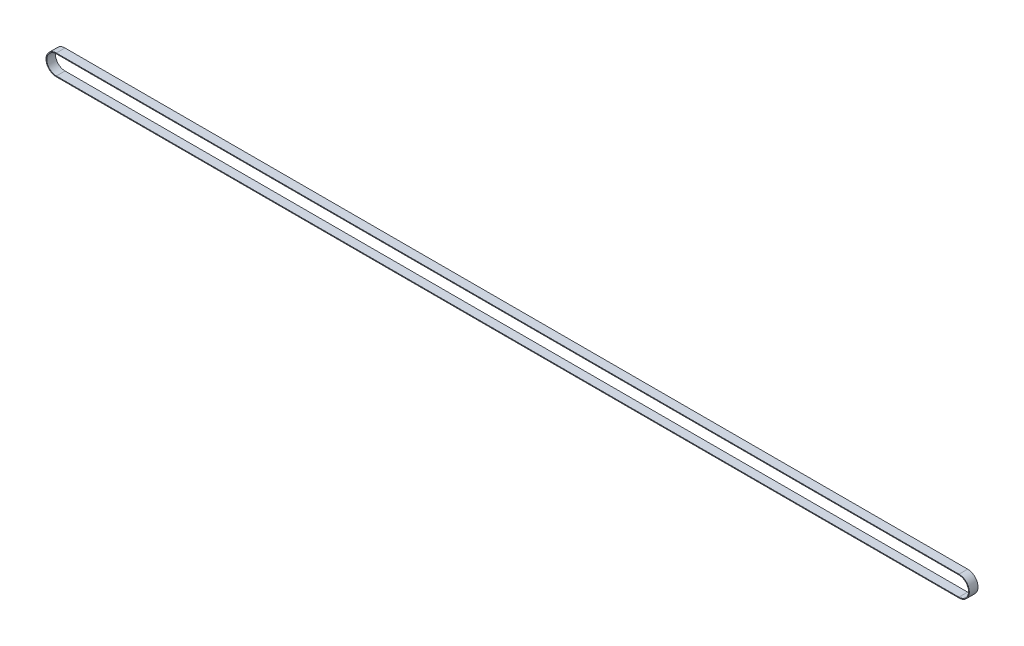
ISO-10303-21;
HEADER;
FILE_DESCRIPTION(('STEP AP214'),'2;1');
FILE_NAME('part.step','',(''),(''),'','','');
FILE_SCHEMA(('AUTOMOTIVE_DESIGN { 1 0 10303 214 1 1 1 1 }'));
ENDSEC;
DATA;
#1=APPLICATION_CONTEXT('core data for automotive mechanical design processes');
#2=APPLICATION_PROTOCOL_DEFINITION('international standard','automotive_design',2000,#1);
#3=PRODUCT_CONTEXT('',#1,'mechanical');
#4=PRODUCT('Part','Part','',(#3));
#5=PRODUCT_RELATED_PRODUCT_CATEGORY('part','',(#4));
#6=PRODUCT_DEFINITION_FORMATION('','',#4);
#7=PRODUCT_DEFINITION_CONTEXT('part definition',#1,'design');
#8=PRODUCT_DEFINITION('design','',#6,#7);
#9=PRODUCT_DEFINITION_SHAPE('','',#8);
#10=(LENGTH_UNIT() NAMED_UNIT(*) SI_UNIT(.MILLI.,.METRE.));
#11=(NAMED_UNIT(*) PLANE_ANGLE_UNIT() SI_UNIT($,.RADIAN.));
#12=(NAMED_UNIT(*) SI_UNIT($,.STERADIAN.) SOLID_ANGLE_UNIT());
#13=UNCERTAINTY_MEASURE_WITH_UNIT(LENGTH_MEASURE(1.E-05),#10,'distance_accuracy_value','');
#14=(GEOMETRIC_REPRESENTATION_CONTEXT(3) GLOBAL_UNCERTAINTY_ASSIGNED_CONTEXT((#13)) GLOBAL_UNIT_ASSIGNED_CONTEXT((#10,
#11,#12)) REPRESENTATION_CONTEXT('',''));
#15=CARTESIAN_POINT('',(0.,0.,0.));
#16=DIRECTION('',(0.,0.,1.));
#17=DIRECTION('',(1.,0.,0.));
#18=AXIS2_PLACEMENT_3D('',#15,#16,#17);
#19=CARTESIAN_POINT('',(2598.49999999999,29.7500000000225,12.5));
#20=DIRECTION('',(0.,0.,-1.));
#21=DIRECTION('',(-1.,0.,0.));
#22=AXIS2_PLACEMENT_3D('',#19,#20,#21);
#23=PLANE('',#22);
#24=DIRECTION('',(0.,-1.,0.));
#25=VECTOR('',#24,1.);
#26=CARTESIAN_POINT('',(2598.49999999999,29.7500000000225,12.5));
#27=LINE('',#26,#25);
#28=CARTESIAN_POINT('',(2598.49999999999,29.7500000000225,12.5));
#29=VERTEX_POINT('',#28);
#30=CARTESIAN_POINT('',(2598.49999999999,27.5500000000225,12.5));
#31=VERTEX_POINT('',#30);
#32=EDGE_CURVE('E151',#29,#31,#27,.T.);
#33=ORIENTED_EDGE('',*,*,#32,.F.);
#34=DIRECTION('',(-1.,0.,0.));
#35=VECTOR('',#34,1.);
#36=CARTESIAN_POINT('',(2598.49999999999,29.7500000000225,12.5));
#37=LINE('',#36,#35);
#38=CARTESIAN_POINT('',(0.,29.7500000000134,12.5));
#39=VERTEX_POINT('',#38);
#40=EDGE_CURVE('E150',#29,#39,#37,.T.);
#41=ORIENTED_EDGE('',*,*,#40,.T.);
#42=DIRECTION('',(0.,-1.,0.));
#43=VECTOR('',#42,1.);
#44=CARTESIAN_POINT('',(0.,29.7500000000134,12.5));
#45=LINE('',#44,#43);
#46=CARTESIAN_POINT('',(0.,27.5500000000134,12.5));
#47=VERTEX_POINT('',#46);
#48=EDGE_CURVE('E129',#39,#47,#45,.T.);
#49=ORIENTED_EDGE('',*,*,#48,.T.);
#50=DIRECTION('',(-1.,0.,0.));
#51=VECTOR('',#50,1.);
#52=CARTESIAN_POINT('',(2598.49999999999,27.5500000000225,12.5));
#53=LINE('',#52,#51);
#54=EDGE_CURVE('E155',#31,#47,#53,.T.);
#55=ORIENTED_EDGE('',*,*,#54,.F.);
#56=EDGE_LOOP('',(#33,#41,#49,#55));
#57=FACE_BOUND('',#56,.T.);
#58=ADVANCED_FACE('F35',(#57),#23,.F.);
#59=CARTESIAN_POINT('',(0.,29.7500000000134,12.5));
#60=DIRECTION('',(0.,0.,-1.));
#61=DIRECTION('',(-1.,0.,0.));
#62=AXIS2_PLACEMENT_3D('',#59,#60,#61);
#63=PLANE('',#62);
#64=CARTESIAN_POINT('',(-6.66133814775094E-12,0.,12.5));
#65=DIRECTION('',(0.,0.,1.));
#66=DIRECTION('',(2.41790858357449E-13,1.,0.));
#67=AXIS2_PLACEMENT_3D('',#64,#65,#66);
#68=CIRCLE('',#67,27.5500000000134);
#69=CARTESIAN_POINT('',(0.,-27.5500000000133,12.5));
#70=VERTEX_POINT('',#69);
#71=EDGE_CURVE('E119',#47,#70,#68,.T.);
#72=ORIENTED_EDGE('',*,*,#71,.F.);
#73=ORIENTED_EDGE('',*,*,#48,.F.);
#74=CARTESIAN_POINT('',(-6.66133814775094E-12,0.,12.5));
#75=DIRECTION('',(0.,0.,1.));
#76=DIRECTION('',(2.23910525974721E-13,1.,0.));
#77=AXIS2_PLACEMENT_3D('',#74,#75,#76);
#78=CIRCLE('',#77,29.7500000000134);
#79=CARTESIAN_POINT('',(0.,-29.7500000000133,12.5));
#80=VERTEX_POINT('',#79);
#81=EDGE_CURVE('E132',#39,#80,#78,.T.);
#82=ORIENTED_EDGE('',*,*,#81,.T.);
#83=DIRECTION('',(0.,1.,0.));
#84=VECTOR('',#83,1.);
#85=CARTESIAN_POINT('',(0.,-29.7500000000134,12.5));
#86=LINE('',#85,#84);
#87=EDGE_CURVE('E147',#80,#70,#86,.T.);
#88=ORIENTED_EDGE('',*,*,#87,.T.);
#89=EDGE_LOOP('',(#72,#73,#82,#88));
#90=FACE_BOUND('',#89,.T.);
#91=ADVANCED_FACE('F131',(#90),#63,.F.);
#92=CARTESIAN_POINT('',(-6.66133814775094E-12,0.,0.));
#93=DIRECTION('',(0.,0.,1.));
#94=DIRECTION('',(1.,0.,0.));
#95=AXIS2_PLACEMENT_3D('',#92,#93,#94);
#96=CYLINDRICAL_SURFACE('',#95,27.5500000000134);
#97=CARTESIAN_POINT('',(-6.66133814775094E-12,0.,-12.5));
#98=DIRECTION('',(0.,0.,1.));
#99=DIRECTION('',(2.41790858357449E-13,1.,0.));
#100=AXIS2_PLACEMENT_3D('',#97,#98,#99);
#101=CIRCLE('',#100,27.5500000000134);
#102=CARTESIAN_POINT('',(0.,27.5500000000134,-12.5));
#103=VERTEX_POINT('',#102);
#104=CARTESIAN_POINT('',(0.,-27.5500000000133,-12.5));
#105=VERTEX_POINT('',#104);
#106=EDGE_CURVE('E113',#103,#105,#101,.T.);
#107=ORIENTED_EDGE('',*,*,#106,.F.);
#108=DIRECTION('',(0.,0.,-1.));
#109=VECTOR('',#108,1.);
#110=CARTESIAN_POINT('',(0.,27.5500000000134,12.5));
#111=LINE('',#110,#109);
#112=EDGE_CURVE('E137',#47,#103,#111,.T.);
#113=ORIENTED_EDGE('',*,*,#112,.F.);
#114=ORIENTED_EDGE('',*,*,#71,.T.);
#115=DIRECTION('',(0.,0.,-1.));
#116=VECTOR('',#115,1.);
#117=CARTESIAN_POINT('',(0.,-27.5500000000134,12.5));
#118=LINE('',#117,#116);
#119=EDGE_CURVE('E195',#70,#105,#118,.T.);
#120=ORIENTED_EDGE('',*,*,#119,.T.);
#121=EDGE_LOOP('',(#107,#113,#114,#120));
#122=FACE_BOUND('',#121,.T.);
#123=ADVANCED_FACE('F214',(#122),#96,.F.);
#124=CARTESIAN_POINT('',(0.,29.7500000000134,-12.5));
#125=DIRECTION('',(0.,0.,1.));
#126=DIRECTION('',(1.,0.,0.));
#127=AXIS2_PLACEMENT_3D('',#124,#125,#126);
#128=PLANE('',#127);
#129=CARTESIAN_POINT('',(-6.66133814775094E-12,0.,-12.5));
#130=DIRECTION('',(0.,0.,1.));
#131=DIRECTION('',(2.23910525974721E-13,1.,0.));
#132=AXIS2_PLACEMENT_3D('',#129,#130,#131);
#133=CIRCLE('',#132,29.7500000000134);
#134=CARTESIAN_POINT('',(0.,29.7500000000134,-12.5));
#135=VERTEX_POINT('',#134);
#136=CARTESIAN_POINT('',(0.,-29.7500000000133,-12.5));
#137=VERTEX_POINT('',#136);
#138=EDGE_CURVE('E165',#135,#137,#133,.T.);
#139=ORIENTED_EDGE('',*,*,#138,.F.);
#140=DIRECTION('',(0.,1.,0.));
#141=VECTOR('',#140,1.);
#142=CARTESIAN_POINT('',(0.,29.7500000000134,-12.5));
#143=LINE('',#142,#141);
#144=EDGE_CURVE('E158',#103,#135,#143,.T.);
#145=ORIENTED_EDGE('',*,*,#144,.F.);
#146=ORIENTED_EDGE('',*,*,#106,.T.);
#147=DIRECTION('',(0.,-1.,0.));
#148=VECTOR('',#147,1.);
#149=CARTESIAN_POINT('',(0.,-29.7500000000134,-12.5));
#150=LINE('',#149,#148);
#151=EDGE_CURVE('E183',#105,#137,#150,.T.);
#152=ORIENTED_EDGE('',*,*,#151,.T.);
#153=EDGE_LOOP('',(#139,#145,#146,#152));
#154=FACE_BOUND('',#153,.T.);
#155=ADVANCED_FACE('F182',(#154),#128,.F.);
#156=CARTESIAN_POINT('',(-6.66133814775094E-12,0.,0.));
#157=DIRECTION('',(0.,0.,1.));
#158=DIRECTION('',(1.,0.,0.));
#159=AXIS2_PLACEMENT_3D('',#156,#157,#158);
#160=CYLINDRICAL_SURFACE('',#159,29.7500000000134);
#161=DIRECTION('',(0.,0.,1.));
#162=VECTOR('',#161,1.);
#163=CARTESIAN_POINT('',(0.,-29.7500000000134,12.5));
#164=LINE('',#163,#162);
#165=EDGE_CURVE('E145',#137,#80,#164,.T.);
#166=ORIENTED_EDGE('',*,*,#165,.T.);
#167=ORIENTED_EDGE('',*,*,#81,.F.);
#168=DIRECTION('',(0.,0.,1.));
#169=VECTOR('',#168,1.);
#170=CARTESIAN_POINT('',(0.,29.7500000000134,12.5));
#171=LINE('',#170,#169);
#172=EDGE_CURVE('E144',#135,#39,#171,.T.);
#173=ORIENTED_EDGE('',*,*,#172,.F.);
#174=ORIENTED_EDGE('',*,*,#138,.T.);
#175=EDGE_LOOP('',(#166,#167,#173,#174));
#176=FACE_BOUND('',#175,.T.);
#177=ADVANCED_FACE('F142',(#176),#160,.T.);
#178=CARTESIAN_POINT('',(0.,-29.7500000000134,12.5));
#179=DIRECTION('',(0.,0.,-1.));
#180=DIRECTION('',(-1.,0.,0.));
#181=AXIS2_PLACEMENT_3D('',#178,#179,#180);
#182=PLANE('',#181);
#183=DIRECTION('',(1.,0.,0.));
#184=VECTOR('',#183,1.);
#185=CARTESIAN_POINT('',(0.,-27.5500000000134,12.5));
#186=LINE('',#185,#184);
#187=CARTESIAN_POINT('',(2598.49999999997,-27.5500000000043,12.5));
#188=VERTEX_POINT('',#187);
#189=EDGE_CURVE('E100',#70,#188,#186,.T.);
#190=ORIENTED_EDGE('',*,*,#189,.F.);
#191=ORIENTED_EDGE('',*,*,#87,.F.);
#192=DIRECTION('',(1.,0.,0.));
#193=VECTOR('',#192,1.);
#194=CARTESIAN_POINT('',(0.,-29.7500000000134,12.5));
#195=LINE('',#194,#193);
#196=CARTESIAN_POINT('',(2598.49999999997,-29.7500000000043,12.5));
#197=VERTEX_POINT('',#196);
#198=EDGE_CURVE('E164',#80,#197,#195,.T.);
#199=ORIENTED_EDGE('',*,*,#198,.T.);
#200=DIRECTION('',(0.,1.,0.));
#201=VECTOR('',#200,1.);
#202=CARTESIAN_POINT('',(2598.49999999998,-29.7500000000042,12.5));
#203=LINE('',#202,#201);
#204=EDGE_CURVE('E205',#197,#188,#203,.T.);
#205=ORIENTED_EDGE('',*,*,#204,.T.);
#206=EDGE_LOOP('',(#190,#191,#199,#205));
#207=FACE_BOUND('',#206,.T.);
#208=ADVANCED_FACE('F210',(#207),#182,.F.);
#209=CARTESIAN_POINT('',(0.,-27.5500000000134,12.5));
#210=DIRECTION('',(0.,-1.,0.));
#211=DIRECTION('',(1.,0.,0.));
#212=AXIS2_PLACEMENT_3D('',#209,#210,#211);
#213=PLANE('',#212);
#214=DIRECTION('',(1.,0.,0.));
#215=VECTOR('',#214,1.);
#216=CARTESIAN_POINT('',(0.,-27.5500000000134,-12.5));
#217=LINE('',#216,#215);
#218=CARTESIAN_POINT('',(2598.49999999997,-27.5500000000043,-12.5));
#219=VERTEX_POINT('',#218);
#220=EDGE_CURVE('E93',#105,#219,#217,.T.);
#221=ORIENTED_EDGE('',*,*,#220,.F.);
#222=ORIENTED_EDGE('',*,*,#119,.F.);
#223=ORIENTED_EDGE('',*,*,#189,.T.);
#224=DIRECTION('',(0.,0.,-1.));
#225=VECTOR('',#224,1.);
#226=CARTESIAN_POINT('',(2598.49999999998,-27.5500000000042,12.5));
#227=LINE('',#226,#225);
#228=EDGE_CURVE('E192',#188,#219,#227,.T.);
#229=ORIENTED_EDGE('',*,*,#228,.T.);
#230=EDGE_LOOP('',(#221,#222,#223,#229));
#231=FACE_BOUND('',#230,.T.);
#232=ADVANCED_FACE('F213',(#231),#213,.F.);
#233=CARTESIAN_POINT('',(0.,-29.7500000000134,-12.5));
#234=DIRECTION('',(0.,0.,1.));
#235=DIRECTION('',(1.,0.,0.));
#236=AXIS2_PLACEMENT_3D('',#233,#234,#235);
#237=PLANE('',#236);
#238=DIRECTION('',(1.,0.,0.));
#239=VECTOR('',#238,1.);
#240=CARTESIAN_POINT('',(0.,-29.7500000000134,-12.5));
#241=LINE('',#240,#239);
#242=CARTESIAN_POINT('',(2598.49999999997,-29.7500000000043,-12.5));
#243=VERTEX_POINT('',#242);
#244=EDGE_CURVE('E84',#137,#243,#241,.T.);
#245=ORIENTED_EDGE('',*,*,#244,.F.);
#246=ORIENTED_EDGE('',*,*,#151,.F.);
#247=ORIENTED_EDGE('',*,*,#220,.T.);
#248=DIRECTION('',(0.,-1.,0.));
#249=VECTOR('',#248,1.);
#250=CARTESIAN_POINT('',(2598.49999999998,-29.7500000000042,-12.5));
#251=LINE('',#250,#249);
#252=EDGE_CURVE('E170',#219,#243,#251,.T.);
#253=ORIENTED_EDGE('',*,*,#252,.T.);
#254=EDGE_LOOP('',(#245,#246,#247,#253));
#255=FACE_BOUND('',#254,.T.);
#256=ADVANCED_FACE('F232',(#255),#237,.F.);
#257=CARTESIAN_POINT('',(0.,-29.7500000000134,12.5));
#258=DIRECTION('',(0.,1.,0.));
#259=DIRECTION('',(-1.,0.,0.));
#260=AXIS2_PLACEMENT_3D('',#257,#258,#259);
#261=PLANE('',#260);
#262=DIRECTION('',(0.,0.,1.));
#263=VECTOR('',#262,1.);
#264=CARTESIAN_POINT('',(2598.49999999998,-29.7500000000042,12.5));
#265=LINE('',#264,#263);
#266=EDGE_CURVE('E166',#243,#197,#265,.T.);
#267=ORIENTED_EDGE('',*,*,#266,.T.);
#268=ORIENTED_EDGE('',*,*,#198,.F.);
#269=ORIENTED_EDGE('',*,*,#165,.F.);
#270=ORIENTED_EDGE('',*,*,#244,.T.);
#271=EDGE_LOOP('',(#267,#268,#269,#270));
#272=FACE_BOUND('',#271,.T.);
#273=ADVANCED_FACE('F224',(#272),#261,.F.);
#274=CARTESIAN_POINT('',(2598.49999999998,-29.7500000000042,12.5));
#275=DIRECTION('',(0.,0.,-1.));
#276=DIRECTION('',(-1.,0.,0.));
#277=AXIS2_PLACEMENT_3D('',#274,#275,#276);
#278=PLANE('',#277);
#279=CARTESIAN_POINT('',(2598.49999999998,9.15933995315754E-12,12.5));
#280=DIRECTION('',(0.,0.,1.));
#281=DIRECTION('',(-2.41790858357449E-13,-1.,0.));
#282=AXIS2_PLACEMENT_3D('',#279,#280,#281);
#283=CIRCLE('',#282,27.5500000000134);
#284=EDGE_CURVE('E190',#188,#31,#283,.T.);
#285=ORIENTED_EDGE('',*,*,#284,.F.);
#286=ORIENTED_EDGE('',*,*,#204,.F.);
#287=CARTESIAN_POINT('',(2598.49999999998,9.15933995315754E-12,12.5));
#288=DIRECTION('',(0.,0.,1.));
#289=DIRECTION('',(-2.23910525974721E-13,-1.,0.));
#290=AXIS2_PLACEMENT_3D('',#287,#288,#289);
#291=CIRCLE('',#290,29.7500000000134);
#292=EDGE_CURVE('E167',#197,#29,#291,.T.);
#293=ORIENTED_EDGE('',*,*,#292,.T.);
#294=ORIENTED_EDGE('',*,*,#32,.T.);
#295=EDGE_LOOP('',(#285,#286,#293,#294));
#296=FACE_BOUND('',#295,.T.);
#297=ADVANCED_FACE('F222',(#296),#278,.F.);
#298=CARTESIAN_POINT('',(2598.49999999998,9.15933995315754E-12,0.));
#299=DIRECTION('',(0.,0.,1.));
#300=DIRECTION('',(1.,0.,0.));
#301=AXIS2_PLACEMENT_3D('',#298,#299,#300);
#302=CYLINDRICAL_SURFACE('',#301,27.5500000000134);
#303=CARTESIAN_POINT('',(2598.49999999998,9.15933995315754E-12,-12.5));
#304=DIRECTION('',(0.,0.,1.));
#305=DIRECTION('',(-2.41790858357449E-13,-1.,0.));
#306=AXIS2_PLACEMENT_3D('',#303,#304,#305);
#307=CIRCLE('',#306,27.5500000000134);
#308=CARTESIAN_POINT('',(2598.49999999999,27.5500000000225,-12.5));
#309=VERTEX_POINT('',#308);
#310=EDGE_CURVE('E60',#219,#309,#307,.T.);
#311=ORIENTED_EDGE('',*,*,#310,.F.);
#312=ORIENTED_EDGE('',*,*,#228,.F.);
#313=ORIENTED_EDGE('',*,*,#284,.T.);
#314=DIRECTION('',(0.,0.,-1.));
#315=VECTOR('',#314,1.);
#316=CARTESIAN_POINT('',(2598.49999999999,27.5500000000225,12.5));
#317=LINE('',#316,#315);
#318=EDGE_CURVE('E188',#31,#309,#317,.T.);
#319=ORIENTED_EDGE('',*,*,#318,.T.);
#320=EDGE_LOOP('',(#311,#312,#313,#319));
#321=FACE_BOUND('',#320,.T.);
#322=ADVANCED_FACE('F219',(#321),#302,.F.);
#323=CARTESIAN_POINT('',(2598.49999999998,-29.7500000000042,-12.5));
#324=DIRECTION('',(0.,0.,1.));
#325=DIRECTION('',(1.,0.,0.));
#326=AXIS2_PLACEMENT_3D('',#323,#324,#325);
#327=PLANE('',#326);
#328=CARTESIAN_POINT('',(2598.49999999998,9.15933995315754E-12,-12.5));
#329=DIRECTION('',(0.,0.,1.));
#330=DIRECTION('',(-2.23910525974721E-13,-1.,0.));
#331=AXIS2_PLACEMENT_3D('',#328,#329,#330);
#332=CIRCLE('',#331,29.7500000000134);
#333=CARTESIAN_POINT('',(2598.49999999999,29.7500000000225,-12.5));
#334=VERTEX_POINT('',#333);
#335=EDGE_CURVE('E52',#243,#334,#332,.T.);
#336=ORIENTED_EDGE('',*,*,#335,.F.);
#337=ORIENTED_EDGE('',*,*,#252,.F.);
#338=ORIENTED_EDGE('',*,*,#310,.T.);
#339=DIRECTION('',(0.,1.,0.));
#340=VECTOR('',#339,1.);
#341=CARTESIAN_POINT('',(2598.49999999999,29.7500000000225,-12.5));
#342=LINE('',#341,#340);
#343=EDGE_CURVE('E175',#309,#334,#342,.T.);
#344=ORIENTED_EDGE('',*,*,#343,.T.);
#345=EDGE_LOOP('',(#336,#337,#338,#344));
#346=FACE_BOUND('',#345,.T.);
#347=ADVANCED_FACE('F230',(#346),#327,.F.);
#348=CARTESIAN_POINT('',(2598.49999999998,9.15933995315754E-12,0.));
#349=DIRECTION('',(0.,0.,1.));
#350=DIRECTION('',(1.,0.,0.));
#351=AXIS2_PLACEMENT_3D('',#348,#349,#350);
#352=CYLINDRICAL_SURFACE('',#351,29.7500000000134);
#353=DIRECTION('',(0.,0.,1.));
#354=VECTOR('',#353,1.);
#355=CARTESIAN_POINT('',(2598.49999999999,29.7500000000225,12.5));
#356=LINE('',#355,#354);
#357=EDGE_CURVE('E39',#334,#29,#356,.T.);
#358=ORIENTED_EDGE('',*,*,#357,.T.);
#359=ORIENTED_EDGE('',*,*,#292,.F.);
#360=ORIENTED_EDGE('',*,*,#266,.F.);
#361=ORIENTED_EDGE('',*,*,#335,.T.);
#362=EDGE_LOOP('',(#358,#359,#360,#361));
#363=FACE_BOUND('',#362,.T.);
#364=ADVANCED_FACE('F176',(#363),#352,.T.);
#365=CARTESIAN_POINT('',(2598.49999999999,27.5500000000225,12.5));
#366=DIRECTION('',(0.,1.,0.));
#367=DIRECTION('',(-1.,0.,0.));
#368=AXIS2_PLACEMENT_3D('',#365,#366,#367);
#369=PLANE('',#368);
#370=ORIENTED_EDGE('',*,*,#54,.T.);
#371=ORIENTED_EDGE('',*,*,#112,.T.);
#372=DIRECTION('',(-1.,0.,0.));
#373=VECTOR('',#372,1.);
#374=CARTESIAN_POINT('',(2598.49999999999,27.5500000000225,-12.5));
#375=LINE('',#374,#373);
#376=EDGE_CURVE('E44',#309,#103,#375,.T.);
#377=ORIENTED_EDGE('',*,*,#376,.F.);
#378=ORIENTED_EDGE('',*,*,#318,.F.);
#379=EDGE_LOOP('',(#370,#371,#377,#378));
#380=FACE_BOUND('',#379,.T.);
#381=ADVANCED_FACE('F216',(#380),#369,.F.);
#382=CARTESIAN_POINT('',(2598.49999999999,29.7500000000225,-12.5));
#383=DIRECTION('',(0.,0.,1.));
#384=DIRECTION('',(1.,0.,0.));
#385=AXIS2_PLACEMENT_3D('',#382,#383,#384);
#386=PLANE('',#385);
#387=ORIENTED_EDGE('',*,*,#376,.T.);
#388=ORIENTED_EDGE('',*,*,#144,.T.);
#389=DIRECTION('',(-1.,0.,0.));
#390=VECTOR('',#389,1.);
#391=CARTESIAN_POINT('',(2598.49999999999,29.7500000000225,-12.5));
#392=LINE('',#391,#390);
#393=EDGE_CURVE('E11',#334,#135,#392,.T.);
#394=ORIENTED_EDGE('',*,*,#393,.F.);
#395=ORIENTED_EDGE('',*,*,#343,.F.);
#396=EDGE_LOOP('',(#387,#388,#394,#395));
#397=FACE_BOUND('',#396,.T.);
#398=ADVANCED_FACE('F180',(#397),#386,.F.);
#399=CARTESIAN_POINT('',(2598.49999999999,29.7500000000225,12.5));
#400=DIRECTION('',(0.,-1.,0.));
#401=DIRECTION('',(1.,0.,0.));
#402=AXIS2_PLACEMENT_3D('',#399,#400,#401);
#403=PLANE('',#402);
#404=ORIENTED_EDGE('',*,*,#393,.T.);
#405=ORIENTED_EDGE('',*,*,#172,.T.);
#406=ORIENTED_EDGE('',*,*,#40,.F.);
#407=ORIENTED_EDGE('',*,*,#357,.F.);
#408=EDGE_LOOP('',(#404,#405,#406,#407));
#409=FACE_BOUND('',#408,.T.);
#410=ADVANCED_FACE('F37',(#409),#403,.F.);
#411=CLOSED_SHELL('',(#58,#91,#123,#155,#177,#208,#232,#256,#273,#297,#322,#347,#364,#381,#398,#410));
#412=MANIFOLD_SOLID_BREP('B2',#411);
#413=ADVANCED_BREP_SHAPE_REPRESENTATION('',(#18,#412),#14);
#414=SHAPE_DEFINITION_REPRESENTATION(#9,#413);
ENDSEC;
END-ISO-10303-21;
